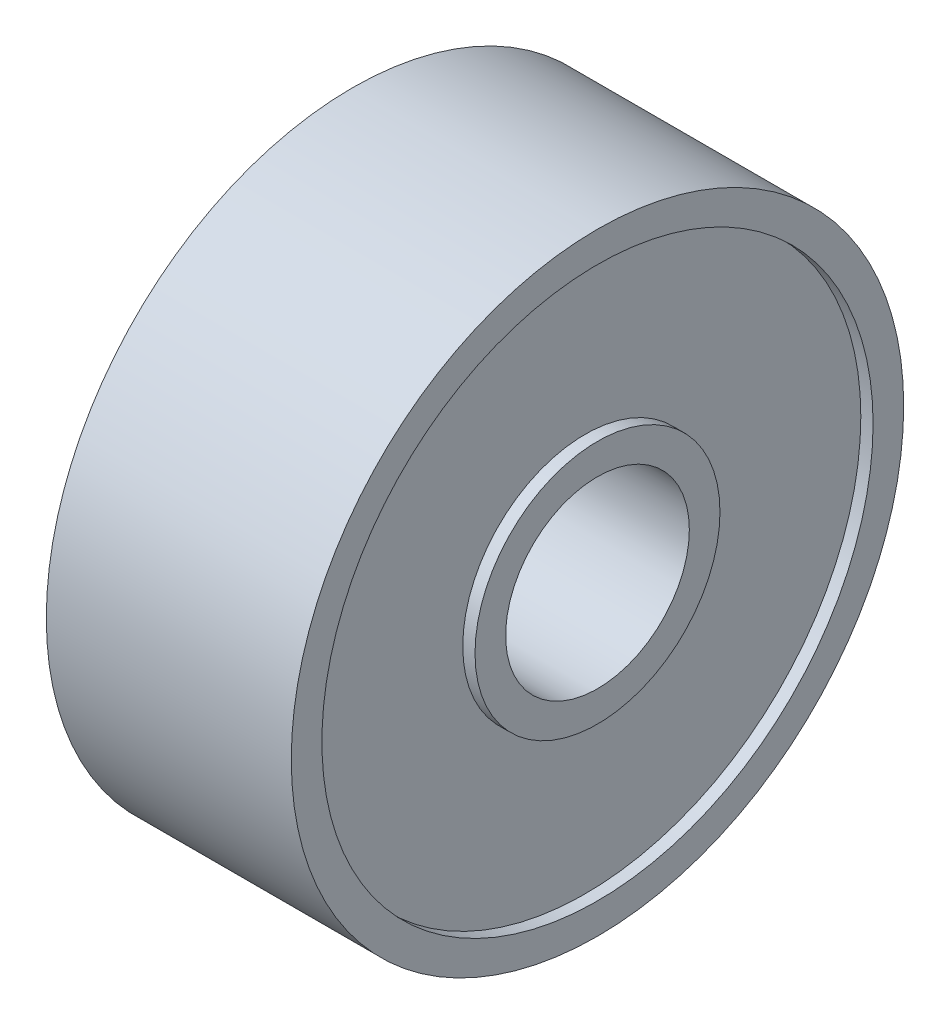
from build123d import *

# Parameters (mm, degrees)
ESQUISSE1_R             = 5
ESQUISSE1_R_2           = 1.5
BOSS_EXTRU_1_DEPTH      = 4
ESQUISSE2_R             = 4.5
ESQUISSE2_R_2           = 2
ENL_V_MAT_EXTRU_1_DEPTH = 0.2
ENL_V_START             = -0.2
ESQUISSE3_R             = 4.5
ESQUISSE3_R_2           = 2
ENL_V_MAT_EXTRU_2_DEPTH = 0.2


with BuildPart() as part:
    # Esquisse1 → Boss.-Extru.1 (new body)
    with BuildSketch(Plane(origin=(0, 0, 0), x_dir=(0, 0, -1), z_dir=(1, 0, 0))):
        Circle(ESQUISSE1_R)
        Circle(ESQUISSE1_R_2, mode=Mode.SUBTRACT)
    extrude(amount=BOSS_EXTRU_1_DEPTH)

    # Esquisse2 → Enl_v. mat.-Extru.1 (cut)
    with BuildSketch(Plane(origin=(4, 0, 0), x_dir=(0, 0, -1), z_dir=(1, 0, 0))):
        Circle(ESQUISSE2_R)
        Circle(ESQUISSE2_R_2, mode=Mode.SUBTRACT)
    extrude(amount=-ENL_V_MAT_EXTRU_1_DEPTH, mode=Mode.SUBTRACT)

    # Esquisse3 → Enl_v. mat.-Extru.2 (cut)
    with BuildSketch(Plane.ZY.offset(ENL_V_START)):
        with Locations(Location((0, 0, 0), (0, 0, 180))):
            Circle(ESQUISSE3_R)
        with Locations(Location((0, 0, 0), (0, 0, 180))):
            Circle(ESQUISSE3_R_2, mode=Mode.SUBTRACT)
    extrude(amount=ENL_V_MAT_EXTRU_2_DEPTH, mode=Mode.SUBTRACT)


solid = part.part
